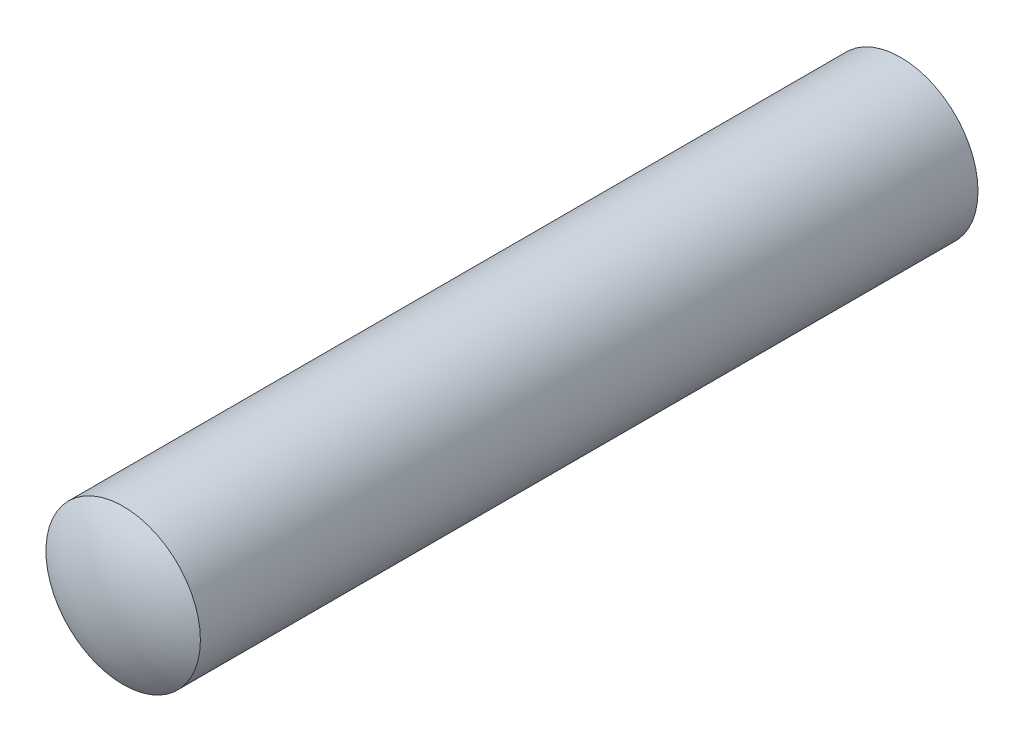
from build123d import *


with BuildPart() as part:
    # E_corps → Corps (revolve)
    with BuildSketch(Plane(origin=(0, 0, 0), x_dir=(0, 0, -1), z_dir=(1, 0, 0)), mode=Mode.PRIVATE) as corps_sk:
        with BuildLine():
            Line((0, 0), (16, 0))
            ThreePointArc((16, 0), (15.885076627, 0.783022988), (15.55, 1.5))
            Line((15.55, 1.5), (0.45, 1.5))
            ThreePointArc((0.45, 1.5), (0.114923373, 0.783022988), (0, 0))
        make_face()
    revolve(corps_sk.sketch.rotate(Axis((0, 0, 10.722897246), (0, 0, -1)), 90), axis=Axis((0, 0, 10.722897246), (0, 0, -1)))


solid = part.part
